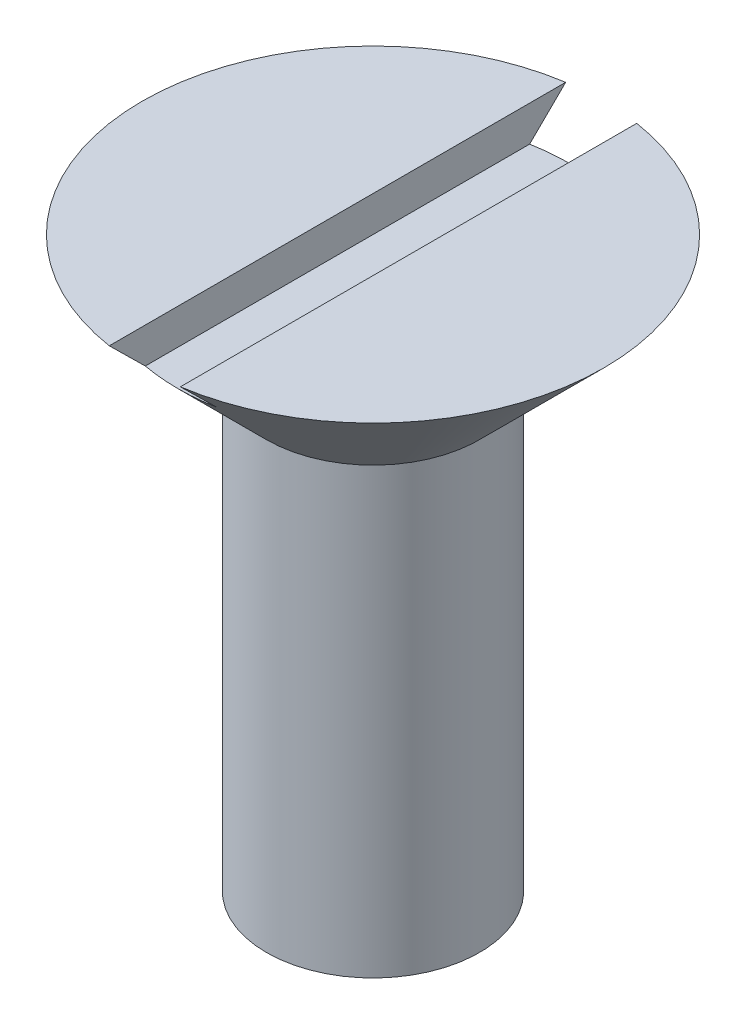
ISO-10303-21;
HEADER;
FILE_DESCRIPTION(('STEP AP214'),'2;1');
FILE_NAME('part.step','',(''),(''),'','','');
FILE_SCHEMA(('AUTOMOTIVE_DESIGN { 1 0 10303 214 1 1 1 1 }'));
ENDSEC;
DATA;
#1=APPLICATION_CONTEXT('core data for automotive mechanical design processes');
#2=APPLICATION_PROTOCOL_DEFINITION('international standard','automotive_design',2000,#1);
#3=PRODUCT_CONTEXT('',#1,'mechanical');
#4=PRODUCT('Part','Part','',(#3));
#5=PRODUCT_RELATED_PRODUCT_CATEGORY('part','',(#4));
#6=PRODUCT_DEFINITION_FORMATION('','',#4);
#7=PRODUCT_DEFINITION_CONTEXT('part definition',#1,'design');
#8=PRODUCT_DEFINITION('design','',#6,#7);
#9=PRODUCT_DEFINITION_SHAPE('','',#8);
#10=(LENGTH_UNIT() NAMED_UNIT(*) SI_UNIT(.MILLI.,.METRE.));
#11=(NAMED_UNIT(*) PLANE_ANGLE_UNIT() SI_UNIT($,.RADIAN.));
#12=(NAMED_UNIT(*) SI_UNIT($,.STERADIAN.) SOLID_ANGLE_UNIT());
#13=UNCERTAINTY_MEASURE_WITH_UNIT(LENGTH_MEASURE(1.E-05),#10,'distance_accuracy_value','');
#14=(GEOMETRIC_REPRESENTATION_CONTEXT(3) GLOBAL_UNCERTAINTY_ASSIGNED_CONTEXT((#13)) GLOBAL_UNIT_ASSIGNED_CONTEXT((#10,
#11,#12)) REPRESENTATION_CONTEXT('',''));
#15=CARTESIAN_POINT('',(0.,0.,0.));
#16=DIRECTION('',(0.,0.,1.));
#17=DIRECTION('',(1.,0.,0.));
#18=AXIS2_PLACEMENT_3D('',#15,#16,#17);
#19=CARTESIAN_POINT('',(0.,0.,0.));
#20=DIRECTION('',(0.,-1.,0.));
#21=DIRECTION('',(0.,0.,-1.));
#22=AXIS2_PLACEMENT_3D('',#19,#20,#21);
#23=PLANE('',#22);
#24=CARTESIAN_POINT('',(0.,0.,0.));
#25=DIRECTION('',(0.,1.,0.));
#26=DIRECTION('',(0.,0.,1.));
#27=AXIS2_PLACEMENT_3D('',#24,#25,#26);
#28=CIRCLE('',#27,6.5);
#29=CARTESIAN_POINT('',(-1.00000000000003,0.,-6.42261628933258));
#30=VERTEX_POINT('',#29);
#31=CARTESIAN_POINT('',(-1.00000000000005,0.,6.42261628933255));
#32=VERTEX_POINT('',#31);
#33=EDGE_CURVE('E434',#30,#32,#28,.T.);
#34=ORIENTED_EDGE('',*,*,#33,.T.);
#35=DIRECTION('',(0.,0.,1.));
#36=VECTOR('',#35,1.);
#37=CARTESIAN_POINT('',(-1.00000000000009,0.,-6.50000000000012));
#38=LINE('',#37,#36);
#39=EDGE_CURVE('E443',#30,#32,#38,.T.);
#40=ORIENTED_EDGE('',*,*,#39,.F.);
#41=EDGE_LOOP('',(#34,#40));
#42=FACE_BOUND('',#41,.T.);
#43=ADVANCED_FACE('F348',(#42),#23,.F.);
#44=CARTESIAN_POINT('',(0.999999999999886,0.,6.42261628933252));
#45=VERTEX_POINT('',#44);
#46=CARTESIAN_POINT('',(1.00000000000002,0.,-6.42261628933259));
#47=VERTEX_POINT('',#46);
#48=EDGE_CURVE('E413',#45,#47,#28,.T.);
#49=ORIENTED_EDGE('',*,*,#48,.T.);
#50=DIRECTION('',(0.,0.,1.));
#51=VECTOR('',#50,1.);
#52=CARTESIAN_POINT('',(0.999999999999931,0.,-6.50000000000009));
#53=LINE('',#52,#51);
#54=EDGE_CURVE('E407',#47,#45,#53,.T.);
#55=ORIENTED_EDGE('',*,*,#54,.T.);
#56=EDGE_LOOP('',(#49,#55));
#57=FACE_BOUND('',#56,.T.);
#58=ADVANCED_FACE('F350',(#57),#23,.F.);
#59=CARTESIAN_POINT('',(0.,-3.49999999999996,0.));
#60=DIRECTION('',(0.,1.,0.));
#61=DIRECTION('',(0.,0.,1.));
#62=AXIS2_PLACEMENT_3D('',#59,#60,#61);
#63=CONICAL_SURFACE('',#62,3.,0.785398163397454);
#64=CARTESIAN_POINT('',(0.,-1.,0.));
#65=DIRECTION('',(0.,-1.,0.));
#66=DIRECTION('',(0.,0.,-1.));
#67=AXIS2_PLACEMENT_3D('',#64,#65,#66);
#68=CIRCLE('',#67,5.49999999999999);
#69=CARTESIAN_POINT('',(1.00000000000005,-1.,5.40832691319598));
#70=VERTEX_POINT('',#69);
#71=CARTESIAN_POINT('',(-1.00000000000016,-1.,5.40832691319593));
#72=VERTEX_POINT('',#71);
#73=EDGE_CURVE('E392',#70,#72,#68,.T.);
#74=ORIENTED_EDGE('',*,*,#73,.T.);
#75=CARTESIAN_POINT('',(-0.999999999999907,-5.273382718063,0.710344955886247));
#76=CARTESIAN_POINT('',(-1.00000000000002,-5.2581719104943,0.736603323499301));
#77=CARTESIAN_POINT('',(-1.00000000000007,-5.24255057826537,0.762618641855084));
#78=CARTESIAN_POINT('',(-1.00000000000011,-5.21061027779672,0.81421033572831));
#79=CARTESIAN_POINT('',(-1.0000000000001,-5.19429146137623,0.839786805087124));
#80=CARTESIAN_POINT('',(-1.00000000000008,-5.14449099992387,0.915903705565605));
#81=CARTESIAN_POINT('',(-1.00000000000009,-5.11013989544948,0.965874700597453));
#82=CARTESIAN_POINT('',(-1.00000000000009,-5.03985598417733,1.0645251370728));
#83=CARTESIAN_POINT('',(-1.00000000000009,-5.00392656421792,1.11320701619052));
#84=CARTESIAN_POINT('',(-1.00000000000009,-4.93083663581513,1.20965256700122));
#85=CARTESIAN_POINT('',(-1.00000000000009,-4.89367583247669,1.25741601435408));
#86=CARTESIAN_POINT('',(-1.00000000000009,-4.78100212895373,1.39939000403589));
#87=CARTESIAN_POINT('',(-1.00000000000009,-4.70412742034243,1.49251692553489));
#88=CARTESIAN_POINT('',(-1.00000000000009,-4.54813199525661,1.67695613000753));
#89=CARTESIAN_POINT('',(-1.0000000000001,-4.46900980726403,1.76826715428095));
#90=CARTESIAN_POINT('',(-1.0000000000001,-4.31413618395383,1.94412624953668));
#91=CARTESIAN_POINT('',(-1.00000000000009,-4.23846999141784,2.02874955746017));
#92=CARTESIAN_POINT('',(-1.00000000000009,-4.08622858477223,2.19717559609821));
#93=CARTESIAN_POINT('',(-1.00000000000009,-4.00965335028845,2.28097830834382));
#94=CARTESIAN_POINT('',(-1.00000000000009,-3.77893807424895,2.53149342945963));
#95=CARTESIAN_POINT('',(-1.00000000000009,-3.62381796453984,2.69730217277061));
#96=CARTESIAN_POINT('',(-1.00000000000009,-3.312095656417,3.0274811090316));
#97=CARTESIAN_POINT('',(-1.00000000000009,-3.155493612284,3.19185144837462));
#98=CARTESIAN_POINT('',(-1.00000000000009,-2.84133414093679,3.51966265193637));
#99=CARTESIAN_POINT('',(-1.00000000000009,-2.68377675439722,3.68310355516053));
#100=CARTESIAN_POINT('',(-1.00000000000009,-2.3674787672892,4.00991527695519));
#101=CARTESIAN_POINT('',(-1.00000000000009,-2.20873596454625,4.1732839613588));
#102=CARTESIAN_POINT('',(-1.00000000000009,-1.89078826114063,4.49957421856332));
#103=CARTESIAN_POINT('',(-1.00000000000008,-1.73158335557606,4.66249578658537));
#104=CARTESIAN_POINT('',(-1.0000000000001,-1.25348497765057,5.15076012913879));
#105=CARTESIAN_POINT('',(-1.00000000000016,-0.934094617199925,5.47561616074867));
#106=CARTESIAN_POINT('',(-1.00000000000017,-0.210016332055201,6.21037120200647));
#107=CARTESIAN_POINT('',(-1.00000000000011,0.194897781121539,6.62004704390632));
#108=CARTESIAN_POINT('',(-1.00000000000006,1.00541960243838,7.43872295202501));
#109=CARTESIAN_POINT('',(-1.00000000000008,1.41102732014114,7.84772300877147));
#110=CARTESIAN_POINT('',(-1.0000000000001,2.22071592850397,8.66333036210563));
#111=CARTESIAN_POINT('',(-1.0000000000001,2.62479476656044,9.06993969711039));
#112=CARTESIAN_POINT('',(-1.00000000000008,3.43323866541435,9.88286057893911));
#113=CARTESIAN_POINT('',(-1.00000000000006,3.8376037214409,10.2891721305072));
#114=CARTESIAN_POINT('',(-1.00000000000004,4.24204998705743,10.6954026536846));
#115=B_SPLINE_CURVE_WITH_KNOTS('',3,(#75,#76,#77,#78,#79,#80,#81,#82,#83,#84,#85,#86,#87,#88,
#89,#90,#91,#92,#93,#94,#95,#96,#97,#98,#99,#100,#101,#102,#103,#104,#105,#106,#107,#108,#109,
#110,#111,#112,#113,#114),.UNSPECIFIED.,.F.,.F.,(4,2,2,2,2,2,2,2,2,2,2,2,2,2,2,2,2,2,2,4),(0.,
0.0910269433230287,0.182034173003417,0.363898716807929,0.54539043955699,0.726925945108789,
1.08913212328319,1.45158118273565,1.79212743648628,2.1326813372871,2.81383195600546,
3.49491242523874,4.17596409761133,4.85933509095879,5.54271336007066,6.90941294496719,
8.63744747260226,10.3655060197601,12.0852435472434,13.804953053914),.UNSPECIFIED.);
#116=EDGE_CURVE('E11',#72,#32,#115,.T.);
#117=ORIENTED_EDGE('',*,*,#116,.T.);
#118=ORIENTED_EDGE('',*,*,#33,.F.);
#119=CARTESIAN_POINT('',(-1.00000000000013,4.24204998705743,-10.6954026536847));
#120=CARTESIAN_POINT('',(-1.0000000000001,3.83650808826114,-10.2880728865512));
#121=CARTESIAN_POINT('',(-1.00000000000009,3.43104879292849,-9.88066074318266));
#122=CARTESIAN_POINT('',(-1.00000000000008,2.62048501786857,-9.0656038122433));
#123=CARTESIAN_POINT('',(-1.00000000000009,2.2153804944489,-8.65795906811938));
#124=CARTESIAN_POINT('',(-1.00000000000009,1.40576030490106,-7.84241430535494));
#125=CARTESIAN_POINT('',(-1.00000000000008,1.00124446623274,-7.43451445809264));
#126=CARTESIAN_POINT('',(-1.00000000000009,0.39496379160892,-6.82212139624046));
#127=CARTESIAN_POINT('',(-1.0000000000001,0.192938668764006,-6.61788589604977));
#128=CARTESIAN_POINT('',(-1.00000000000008,-0.210884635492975,-6.20918418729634));
#129=CARTESIAN_POINT('',(-1.00000000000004,-0.412682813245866,-6.00471797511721));
#130=CARTESIAN_POINT('',(-1.00000000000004,-0.816139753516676,-5.59530867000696));
#131=CARTESIAN_POINT('',(-1.00000000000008,-1.01779825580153,-5.39036532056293));
#132=CARTESIAN_POINT('',(-1.0000000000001,-1.42067346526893,-4.98006763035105));
#133=CARTESIAN_POINT('',(-1.00000000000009,-1.62189019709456,-4.77471331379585));
#134=CARTESIAN_POINT('',(-1.00000000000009,-2.02360991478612,-4.36348498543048));
#135=CARTESIAN_POINT('',(-1.00000000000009,-2.22411317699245,-4.15761124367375));
#136=CARTESIAN_POINT('',(-1.00000000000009,-2.62421593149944,-3.74490344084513));
#137=CARTESIAN_POINT('',(-1.00000000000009,-2.82381523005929,-3.53806919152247));
#138=CARTESIAN_POINT('',(-1.00000000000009,-3.12218974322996,-3.22652746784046));
#139=CARTESIAN_POINT('',(-1.00000000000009,-3.22155363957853,-3.12238410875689));
#140=CARTESIAN_POINT('',(-1.00000000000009,-3.41974443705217,-2.913598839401));
#141=CARTESIAN_POINT('',(-1.00000000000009,-3.51857136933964,-2.80895695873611));
#142=CARTESIAN_POINT('',(-1.00000000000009,-3.7154347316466,-2.5990635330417));
#143=CARTESIAN_POINT('',(-1.00000000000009,-3.81347164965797,-2.49381244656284));
#144=CARTESIAN_POINT('',(-1.00000000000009,-4.00853654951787,-2.28233653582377));
#145=CARTESIAN_POINT('',(-1.00000000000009,-4.10556431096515,-2.17611150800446));
#146=CARTESIAN_POINT('',(-1.00000000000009,-4.29833030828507,-1.9620263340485));
#147=CARTESIAN_POINT('',(-1.00000000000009,-4.39406488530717,-1.8541628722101));
#148=CARTESIAN_POINT('',(-1.00000000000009,-4.53579687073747,-1.69080300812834));
#149=CARTESIAN_POINT('',(-1.00000000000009,-4.58271485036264,-1.63610627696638));
#150=CARTESIAN_POINT('',(-1.00000000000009,-4.67575148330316,-1.52602499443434));
#151=CARTESIAN_POINT('',(-1.00000000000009,-4.7218700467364,-1.47064036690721));
#152=CARTESIAN_POINT('',(-1.00000000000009,-4.81316486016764,-1.35884423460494));
#153=CARTESIAN_POINT('',(-1.00000000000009,-4.85833819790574,-1.30243034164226));
#154=CARTESIAN_POINT('',(-1.00000000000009,-4.9472006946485,-1.18846945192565));
#155=CARTESIAN_POINT('',(-1.00000000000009,-4.99089031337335,-1.13092281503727));
#156=CARTESIAN_POINT('',(-1.00000000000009,-5.07628948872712,-1.01417260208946));
#157=CARTESIAN_POINT('',(-1.00000000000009,-5.11799465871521,-0.954965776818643));
#158=CARTESIAN_POINT('',(-1.00000000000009,-5.17826152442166,-0.864577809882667));
#159=CARTESIAN_POINT('',(-1.0000000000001,-5.19797853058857,-0.8341689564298));
#160=CARTESIAN_POINT('',(-1.00000000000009,-5.23645181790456,-0.772737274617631));
#161=CARTESIAN_POINT('',(-1.00000000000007,-5.2552077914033,-0.741714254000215));
#162=CARTESIAN_POINT('',(-1.00000000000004,-5.273382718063,-0.710344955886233));
#163=B_SPLINE_CURVE_WITH_KNOTS('',3,(#119,#120,#121,#122,#123,#124,#125,#126,#127,#128,#129,
#130,#131,#132,#133,#134,#135,#136,#137,#138,#139,#140,#141,#142,#143,#144,#145,#146,#147,#148,
#149,#150,#151,#152,#153,#154,#155,#156,#157,#158,#159,#160,#161,#162),.UNSPECIFIED.,.F.,.F.,(4,
2,2,2,2,2,2,2,2,2,2,2,2,2,2,2,2,2,2,2,2,4),(0.,1.72436549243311,3.44847533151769,
5.17188358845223,6.03370513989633,6.89554039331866,7.75810091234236,8.62061202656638,
9.48274162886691,10.3450480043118,10.7768697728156,11.2086662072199,11.6401715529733,
12.0717692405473,12.5044040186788,12.7205863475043,12.9367928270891,13.1535888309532,
13.3703170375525,13.5875039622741,13.6962130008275,13.8049566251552),.UNSPECIFIED.);
#164=CARTESIAN_POINT('',(-1.00000000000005,-1.,-5.40832691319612));
#165=VERTEX_POINT('',#164);
#166=EDGE_CURVE('E398',#30,#165,#163,.T.);
#167=ORIENTED_EDGE('',*,*,#166,.T.);
#168=CARTESIAN_POINT('',(1.00000000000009,-1.,-5.40832691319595));
#169=VERTEX_POINT('',#168);
#170=EDGE_CURVE('E400',#165,#169,#68,.T.);
#171=ORIENTED_EDGE('',*,*,#170,.T.);
#172=CARTESIAN_POINT('',(1.00000000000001,-5.273382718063,-0.710344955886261));
#173=CARTESIAN_POINT('',(0.999999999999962,-5.25817191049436,-0.736603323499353));
#174=CARTESIAN_POINT('',(0.999999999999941,-5.24255057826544,-0.762618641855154));
#175=CARTESIAN_POINT('',(0.999999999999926,-5.2106102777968,-0.814210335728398));
#176=CARTESIAN_POINT('',(0.999999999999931,-5.1942914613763,-0.839786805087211));
#177=CARTESIAN_POINT('',(0.999999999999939,-5.14449099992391,-0.915903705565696));
#178=CARTESIAN_POINT('',(0.999999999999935,-5.11013989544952,-0.965874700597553));
#179=CARTESIAN_POINT('',(0.999999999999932,-5.03985598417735,-1.06452513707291));
#180=CARTESIAN_POINT('',(0.999999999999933,-5.00392656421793,-1.11320701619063));
#181=CARTESIAN_POINT('',(0.999999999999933,-4.93083663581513,-1.20965256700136));
#182=CARTESIAN_POINT('',(0.999999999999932,-4.89367583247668,-1.25741601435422));
#183=CARTESIAN_POINT('',(0.999999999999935,-4.78100212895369,-1.39939000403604));
#184=CARTESIAN_POINT('',(0.999999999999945,-4.70412742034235,-1.49251692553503));
#185=CARTESIAN_POINT('',(0.999999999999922,-4.54813199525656,-1.67695613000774));
#186=CARTESIAN_POINT('',(0.999999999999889,-4.46900980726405,-1.76826715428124));
#187=CARTESIAN_POINT('',(0.999999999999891,-4.31413618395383,-1.94412624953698));
#188=CARTESIAN_POINT('',(0.999999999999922,-4.23846999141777,-2.02874955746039));
#189=CARTESIAN_POINT('',(0.999999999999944,-4.0862285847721,-2.19717559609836));
#190=CARTESIAN_POINT('',(0.999999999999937,-4.00965335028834,-2.28097830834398));
#191=CARTESIAN_POINT('',(0.999999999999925,-3.77893807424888,-2.53149342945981));
#192=CARTESIAN_POINT('',(0.999999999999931,-3.62381796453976,-2.69730217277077));
#193=CARTESIAN_POINT('',(0.999999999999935,-3.31209565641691,-3.02748110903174));
#194=CARTESIAN_POINT('',(0.999999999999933,-3.15549361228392,-3.19185144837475));
#195=CARTESIAN_POINT('',(0.999999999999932,-2.84133414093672,-3.51966265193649));
#196=CARTESIAN_POINT('',(0.999999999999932,-2.68377675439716,-3.68310355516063));
#197=CARTESIAN_POINT('',(0.999999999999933,-2.36747876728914,-4.00991527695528));
#198=CARTESIAN_POINT('',(0.999999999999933,-2.2087359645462,-4.17328396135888));
#199=CARTESIAN_POINT('',(0.999999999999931,-1.8907882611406,-4.49957421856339));
#200=CARTESIAN_POINT('',(0.999999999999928,-1.73158335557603,-4.66249578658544));
#201=CARTESIAN_POINT('',(0.99999999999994,-1.25348497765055,-5.15076012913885));
#202=CARTESIAN_POINT('',(0.999999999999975,-0.934094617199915,-5.47561616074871));
#203=CARTESIAN_POINT('',(0.999999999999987,-0.210016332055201,-6.21037120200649));
#204=CARTESIAN_POINT('',(0.999999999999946,0.194897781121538,-6.62004704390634));
#205=CARTESIAN_POINT('',(0.999999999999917,1.00541960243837,-7.43872295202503));
#206=CARTESIAN_POINT('',(0.999999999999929,1.41102732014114,-7.84772300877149));
#207=CARTESIAN_POINT('',(0.999999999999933,2.22071592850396,-8.66333036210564));
#208=CARTESIAN_POINT('',(0.999999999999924,2.62479476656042,-9.06993969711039));
#209=CARTESIAN_POINT('',(0.999999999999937,3.43323866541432,-9.88286057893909));
#210=CARTESIAN_POINT('',(0.999999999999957,3.83760372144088,-10.2891721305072));
#211=CARTESIAN_POINT('',(1.00000000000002,4.24204998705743,-10.6954026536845));
#212=B_SPLINE_CURVE_WITH_KNOTS('',3,(#172,#173,#174,#175,#176,#177,#178,#179,#180,#181,#182,
#183,#184,#185,#186,#187,#188,#189,#190,#191,#192,#193,#194,#195,#196,#197,#198,#199,#200,#201,
#202,#203,#204,#205,#206,#207,#208,#209,#210,#211),.UNSPECIFIED.,.F.,.F.,(4,2,2,2,2,2,2,2,2,2,2,
2,2,2,2,2,2,2,2,4),(0.,0.091026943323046,0.18203417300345,0.363898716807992,0.545390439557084,
0.726925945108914,1.08913212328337,1.45158118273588,1.79212743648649,2.1326813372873,
2.81383195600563,3.49491242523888,4.17596409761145,4.85933509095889,5.54271336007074,
6.90941294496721,8.63744747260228,10.3655060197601,12.0852435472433,13.804953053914),.UNSPECIFIED.);
#213=EDGE_CURVE('E405',#169,#47,#212,.T.);
#214=ORIENTED_EDGE('',*,*,#213,.T.);
#215=ORIENTED_EDGE('',*,*,#48,.F.);
#216=CARTESIAN_POINT('',(1.00000000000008,4.24204998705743,10.6954026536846));
#217=CARTESIAN_POINT('',(0.999999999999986,3.83650808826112,10.2880728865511));
#218=CARTESIAN_POINT('',(0.999999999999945,3.43104879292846,9.88066074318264));
#219=CARTESIAN_POINT('',(0.999999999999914,2.62048501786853,9.06560381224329));
#220=CARTESIAN_POINT('',(0.999999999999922,2.21538049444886,8.65795906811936));
#221=CARTESIAN_POINT('',(0.999999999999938,1.40576030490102,7.84241430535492));
#222=CARTESIAN_POINT('',(0.999999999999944,1.0012444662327,7.43451445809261));
#223=CARTESIAN_POINT('',(0.999999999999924,0.394963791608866,6.82212139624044));
#224=CARTESIAN_POINT('',(0.999999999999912,0.192938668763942,6.61788589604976));
#225=CARTESIAN_POINT('',(0.999999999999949,-0.210884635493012,6.2091841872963));
#226=CARTESIAN_POINT('',(0.999999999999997,-0.412682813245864,6.00471797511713));
#227=CARTESIAN_POINT('',(0.999999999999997,-0.816139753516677,5.59530867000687));
#228=CARTESIAN_POINT('',(0.999999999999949,-1.01779825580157,5.39036532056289));
#229=CARTESIAN_POINT('',(0.999999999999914,-1.420673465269,4.98006763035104));
#230=CARTESIAN_POINT('',(0.999999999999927,-1.62189019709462,4.77471331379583));
#231=CARTESIAN_POINT('',(0.999999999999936,-2.02360991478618,4.36348498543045));
#232=CARTESIAN_POINT('',(0.999999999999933,-2.22411317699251,4.15761124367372));
#233=CARTESIAN_POINT('',(0.999999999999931,-2.6242159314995,3.74490344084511));
#234=CARTESIAN_POINT('',(0.999999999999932,-2.82381523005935,3.53806919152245));
#235=CARTESIAN_POINT('',(0.999999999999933,-3.12218974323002,3.22652746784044));
#236=CARTESIAN_POINT('',(0.999999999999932,-3.22155363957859,3.12238410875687));
#237=CARTESIAN_POINT('',(0.999999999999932,-3.41974443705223,2.91359883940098));
#238=CARTESIAN_POINT('',(0.999999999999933,-3.51857136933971,2.80895695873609));
#239=CARTESIAN_POINT('',(0.999999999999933,-3.71543473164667,2.59906353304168));
#240=CARTESIAN_POINT('',(0.999999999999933,-3.81347164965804,2.49381244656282));
#241=CARTESIAN_POINT('',(0.999999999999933,-4.00853654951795,2.28233653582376));
#242=CARTESIAN_POINT('',(0.999999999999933,-4.10556431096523,2.17611150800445));
#243=CARTESIAN_POINT('',(0.999999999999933,-4.29833030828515,1.96202633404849));
#244=CARTESIAN_POINT('',(0.999999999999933,-4.39406488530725,1.85416287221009));
#245=CARTESIAN_POINT('',(0.999999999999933,-4.53579687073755,1.69080300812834));
#246=CARTESIAN_POINT('',(0.999999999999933,-4.58271485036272,1.63610627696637));
#247=CARTESIAN_POINT('',(0.999999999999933,-4.67575148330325,1.52602499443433));
#248=CARTESIAN_POINT('',(0.999999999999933,-4.72187004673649,1.47064036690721));
#249=CARTESIAN_POINT('',(0.999999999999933,-4.81316486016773,1.35884423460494));
#250=CARTESIAN_POINT('',(0.999999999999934,-4.85833819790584,1.30243034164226));
#251=CARTESIAN_POINT('',(0.999999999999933,-4.9472006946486,1.18846945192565));
#252=CARTESIAN_POINT('',(0.999999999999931,-4.99089031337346,1.13092281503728));
#253=CARTESIAN_POINT('',(0.999999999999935,-5.07628948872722,1.01417260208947));
#254=CARTESIAN_POINT('',(0.999999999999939,-5.11799465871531,0.95496577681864));
#255=CARTESIAN_POINT('',(0.99999999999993,-5.17826152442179,0.864577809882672));
#256=CARTESIAN_POINT('',(0.999999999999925,-5.1979785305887,0.834168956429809));
#257=CARTESIAN_POINT('',(0.999999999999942,-5.23645181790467,0.772737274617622));
#258=CARTESIAN_POINT('',(0.999999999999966,-5.25520779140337,0.741714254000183));
#259=CARTESIAN_POINT('',(1.00000000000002,-5.273382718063,0.71034495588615));
#260=B_SPLINE_CURVE_WITH_KNOTS('',3,(#216,#217,#218,#219,#220,#221,#222,#223,#224,#225,#226,
#227,#228,#229,#230,#231,#232,#233,#234,#235,#236,#237,#238,#239,#240,#241,#242,#243,#244,#245,
#246,#247,#248,#249,#250,#251,#252,#253,#254,#255,#256,#257,#258,#259),.UNSPECIFIED.,.F.,.F.,(4,
2,2,2,2,2,2,2,2,2,2,2,2,2,2,2,2,2,2,2,2,4),(0.,1.72436549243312,3.44847533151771,
5.17188358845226,6.03370513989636,6.89554039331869,7.75810091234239,8.62061202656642,
9.48274162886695,10.3450480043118,10.7768697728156,11.2086662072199,11.6401715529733,
12.0717692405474,12.5044040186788,12.7205863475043,12.9367928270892,13.1535888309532,
13.3703170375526,13.5875039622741,13.6962130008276,13.8049566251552),.UNSPECIFIED.);
#261=EDGE_CURVE('E360',#45,#70,#260,.T.);
#262=ORIENTED_EDGE('',*,*,#261,.T.);
#263=EDGE_LOOP('',(#74,#117,#118,#167,#171,#214,#215,#262));
#264=FACE_BOUND('',#263,.T.);
#265=CARTESIAN_POINT('',(0.,-3.49999999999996,0.));
#266=DIRECTION('',(0.,1.,0.));
#267=DIRECTION('',(0.,0.,1.));
#268=AXIS2_PLACEMENT_3D('',#265,#266,#267);
#269=CIRCLE('',#268,3.);
#270=CARTESIAN_POINT('',(0.,-3.49999999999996,3.));
#271=VERTEX_POINT('',#270);
#272=EDGE_CURVE('E437',#271,#271,#269,.T.);
#273=ORIENTED_EDGE('',*,*,#272,.T.);
#274=EDGE_LOOP('',(#273));
#275=FACE_BOUND('',#274,.T.);
#276=ADVANCED_FACE('F410',(#264,#275),#63,.T.);
#277=CARTESIAN_POINT('',(0.,0.,0.));
#278=DIRECTION('',(0.,1.,0.));
#279=DIRECTION('',(0.,0.,1.));
#280=AXIS2_PLACEMENT_3D('',#277,#278,#279);
#281=CYLINDRICAL_SURFACE('',#280,3.);
#282=ORIENTED_EDGE('',*,*,#272,.F.);
#283=EDGE_LOOP('',(#282));
#284=FACE_BOUND('',#283,.T.);
#285=CARTESIAN_POINT('',(0.,-16.,0.));
#286=DIRECTION('',(0.,1.,0.));
#287=DIRECTION('',(0.,0.,1.));
#288=AXIS2_PLACEMENT_3D('',#285,#286,#287);
#289=CIRCLE('',#288,3.);
#290=CARTESIAN_POINT('',(0.,-16.,3.));
#291=VERTEX_POINT('',#290);
#292=EDGE_CURVE('E440',#291,#291,#289,.T.);
#293=ORIENTED_EDGE('',*,*,#292,.T.);
#294=EDGE_LOOP('',(#293));
#295=FACE_BOUND('',#294,.T.);
#296=ADVANCED_FACE('F461',(#284,#295),#281,.T.);
#297=CARTESIAN_POINT('',(0.,-17.7320508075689,0.));
#298=DIRECTION('',(0.,1.,0.));
#299=DIRECTION('',(0.,0.,1.));
#300=AXIS2_PLACEMENT_3D('',#297,#298,#299);
#301=CONICAL_SURFACE('',#300,0.,1.04719755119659);
#302=ORIENTED_EDGE('',*,*,#292,.F.);
#303=EDGE_LOOP('',(#302));
#304=FACE_BOUND('',#303,.T.);
#305=CARTESIAN_POINT('',(0.,-17.7320508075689,0.));
#306=VERTEX_POINT('',#305);
#307=VERTEX_LOOP('',#306);
#308=FACE_BOUND('',#307,.T.);
#309=ADVANCED_FACE('F465',(#304,#308),#301,.T.);
#310=CARTESIAN_POINT('',(-1.00000000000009,0.,-6.50000000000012));
#311=DIRECTION('',(-1.,0.,0.));
#312=DIRECTION('',(0.,-1.,0.));
#313=AXIS2_PLACEMENT_3D('',#310,#311,#312);
#314=PLANE('',#313);
#315=ORIENTED_EDGE('',*,*,#39,.T.);
#316=ORIENTED_EDGE('',*,*,#116,.F.);
#317=DIRECTION('',(0.,0.,1.));
#318=VECTOR('',#317,1.);
#319=CARTESIAN_POINT('',(-1.00000000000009,-1.,-6.50000000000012));
#320=LINE('',#319,#318);
#321=EDGE_CURVE('E395',#165,#72,#320,.T.);
#322=ORIENTED_EDGE('',*,*,#321,.F.);
#323=ORIENTED_EDGE('',*,*,#166,.F.);
#324=EDGE_LOOP('',(#315,#316,#322,#323));
#325=FACE_BOUND('',#324,.T.);
#326=ADVANCED_FACE('F428',(#325),#314,.F.);
#327=CARTESIAN_POINT('',(0.999999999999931,0.,-6.50000000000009));
#328=DIRECTION('',(1.,0.,0.));
#329=DIRECTION('',(0.,1.,0.));
#330=AXIS2_PLACEMENT_3D('',#327,#328,#329);
#331=PLANE('',#330);
#332=DIRECTION('',(0.,0.,1.));
#333=VECTOR('',#332,1.);
#334=CARTESIAN_POINT('',(0.999999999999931,-1.,-6.50000000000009));
#335=LINE('',#334,#333);
#336=EDGE_CURVE('E367',#169,#70,#335,.T.);
#337=ORIENTED_EDGE('',*,*,#336,.T.);
#338=ORIENTED_EDGE('',*,*,#261,.F.);
#339=ORIENTED_EDGE('',*,*,#54,.F.);
#340=ORIENTED_EDGE('',*,*,#213,.F.);
#341=EDGE_LOOP('',(#337,#338,#339,#340));
#342=FACE_BOUND('',#341,.T.);
#343=ADVANCED_FACE('F402',(#342),#331,.F.);
#344=CARTESIAN_POINT('',(-1.00000000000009,-1.,-6.50000000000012));
#345=DIRECTION('',(0.,-1.,0.));
#346=DIRECTION('',(0.,0.,-1.));
#347=AXIS2_PLACEMENT_3D('',#344,#345,#346);
#348=PLANE('',#347);
#349=ORIENTED_EDGE('',*,*,#336,.F.);
#350=ORIENTED_EDGE('',*,*,#170,.F.);
#351=ORIENTED_EDGE('',*,*,#321,.T.);
#352=ORIENTED_EDGE('',*,*,#73,.F.);
#353=EDGE_LOOP('',(#349,#350,#351,#352));
#354=FACE_BOUND('',#353,.T.);
#355=ADVANCED_FACE('F393',(#354),#348,.F.);
#356=CLOSED_SHELL('',(#43,#58,#276,#296,#309,#326,#343,#355));
#357=MANIFOLD_SOLID_BREP('B2',#356);
#358=ADVANCED_BREP_SHAPE_REPRESENTATION('',(#18,#357),#14);
#359=SHAPE_DEFINITION_REPRESENTATION(#9,#358);
ENDSEC;
END-ISO-10303-21;
